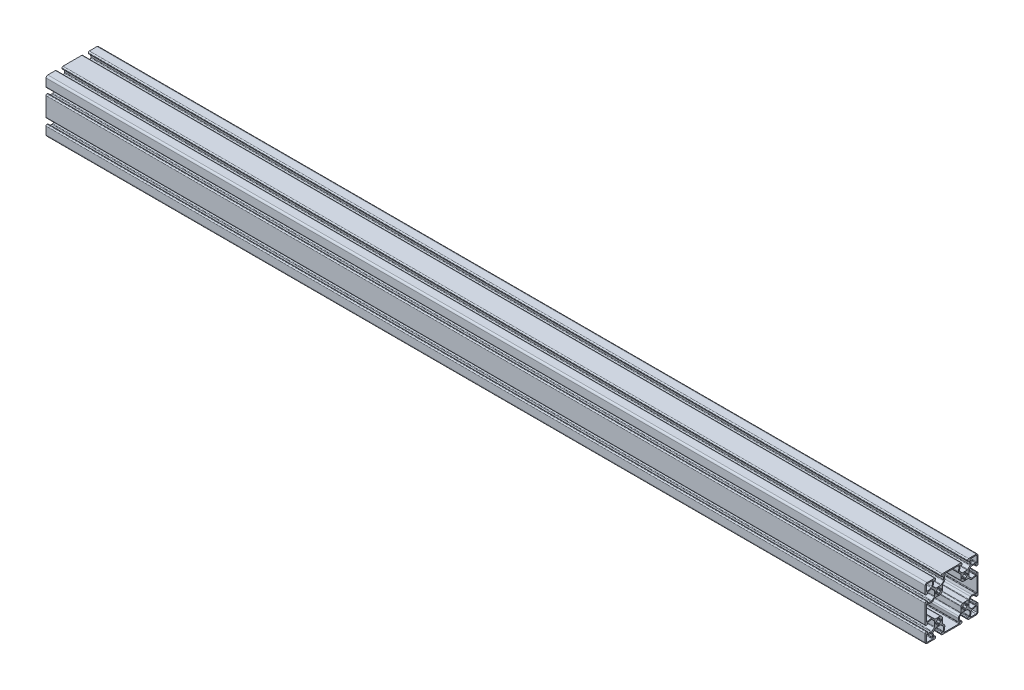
from build123d import *

# Parameters (mm, degrees)
EXTRUDE_1_DEPTH = 1000


with BuildPart() as part:
    # Sketch 1 → Extrude 1 (new body)
    with BuildSketch(Plane(origin=(0, 0, 0), x_dir=(0, 0, -1), z_dir=(1, 0, 0))):
        with BuildLine():
            Line((-15, 25.65), (-15, 4.35))
            ThreePointArc((-15, 4.35), (-14.648528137, 3.501471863), (-13.8, 3.15))
            Line((-13.8, 3.15), (-13.25, 3.15))
            ThreePointArc((-13.25, 3.15), (-12.719669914, 3.369669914), (-12.5, 3.9))
            Line((-12.5, 3.9), (-12.5, 4.874840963))
            ThreePointArc((-12.5, 4.874840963), (-12.383022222, 5.196234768), (-12.086824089, 5.367244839))
            Line((-12.086824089, 5.367244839), (-8.089371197, 6.072103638))
            ThreePointArc((-8.089371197, 6.072103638), (-7.615017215, 6.04101284), (-7.208616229, 5.794402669))
            Line((-7.208616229, 5.794402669), (-4.792893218, 3.378679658))
            ThreePointArc((-4.792893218, 3.378679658), (-4.576120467, 3.05425631), (-4.499999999, 2.671572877))
            Line((-4.499999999, 2.671572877), (-4.499999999, -2.671572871))
            ThreePointArc((-4.499999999, -2.671572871), (-4.576120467, -3.054256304), (-4.792893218, -3.378679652))
            Line((-4.792893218, -3.378679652), (-7.20861623, -5.794402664))
            ThreePointArc((-7.20861623, -5.794402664), (-7.615017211, -6.041012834), (-8.089371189, -6.072103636))
            Line((-8.089371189, -6.072103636), (-12.086824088, -5.367244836))
            ThreePointArc((-12.086824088, -5.367244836), (-12.383022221, -5.196234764), (-12.499999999, -4.874840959))
            Line((-12.499999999, -4.874840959), (-12.499999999, -3.899999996))
            ThreePointArc((-12.499999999, -3.899999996), (-12.719669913, -3.36966991), (-13.249999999, -3.149999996))
            Line((-13.249999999, -3.149999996), (-13.799999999, -3.149999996))
            ThreePointArc((-13.799999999, -3.149999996), (-14.648528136, -3.501471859), (-14.999999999, -4.349999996))
            Line((-14.999999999, -4.349999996), (-14.999999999, -12.999999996))
            ThreePointArc((-14.999999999, -12.999999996), (-14.414213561, -14.414213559), (-12.999999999, -14.999999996))
            Line((-12.999999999, -14.999999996), (-4.349999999, -14.999999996))
            ThreePointArc((-4.349999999, -14.999999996), (-3.501471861, -14.648528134), (-3.149999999, -13.799999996))
            Line((-3.149999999, -13.799999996), (-3.149999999, -13.249999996))
            ThreePointArc((-3.149999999, -13.249999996), (-3.369669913, -12.719669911), (-3.899999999, -12.499999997))
            Line((-3.899999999, -12.499999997), (-4.874840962, -12.499999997))
            ThreePointArc((-4.874840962, -12.499999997), (-5.196234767, -12.383022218), (-5.367244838, -12.086824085))
            Line((-5.367244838, -12.086824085), (-6.072103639, -8.089371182))
            ThreePointArc((-6.072103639, -8.089371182), (-6.041012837, -7.615017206), (-5.794402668, -7.208616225))
            Line((-5.794402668, -7.208616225), (-3.378679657, -4.792893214))
            ThreePointArc((-3.378679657, -4.792893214), (-3.054256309, -4.576120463), (-2.671572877, -4.499999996))
            Line((-2.671572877, -4.499999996), (2.671572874, -4.499999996))
            ThreePointArc((2.671572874, -4.499999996), (3.054256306, -4.576120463), (3.378679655, -4.792893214))
            Line((3.378679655, -4.792893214), (5.794402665, -7.208616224))
            ThreePointArc((5.794402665, -7.208616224), (6.041012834, -7.615017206), (6.072103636, -8.089371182))
            Line((6.072103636, -8.089371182), (5.367244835, -12.086824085))
            ThreePointArc((5.367244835, -12.086824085), (5.196234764, -12.383022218), (4.874840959, -12.499999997))
            Line((4.874840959, -12.499999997), (3.899999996, -12.499999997))
            ThreePointArc((3.899999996, -12.499999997), (3.36966991, -12.719669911), (3.149999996, -13.249999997))
            Line((3.149999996, -13.249999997), (3.149999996, -13.799999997))
            ThreePointArc((3.149999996, -13.799999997), (3.501471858, -14.648528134), (4.349999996, -14.999999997))
            Line((4.349999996, -14.999999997), (25.649999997, -14.999999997))
            ThreePointArc((25.649999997, -14.999999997), (26.498528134, -14.648528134), (26.849999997, -13.799999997))
            Line((26.849999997, -13.799999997), (26.849999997, -13.249999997))
            ThreePointArc((26.849999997, -13.249999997), (26.630330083, -12.719669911), (26.099999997, -12.499999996))
            Line((26.099999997, -12.499999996), (25.125159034, -12.499999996))
            ThreePointArc((25.125159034, -12.499999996), (24.803765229, -12.383022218), (24.632755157, -12.086824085))
            Line((24.632755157, -12.086824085), (23.927896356, -8.089371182))
            ThreePointArc((23.927896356, -8.089371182), (23.958987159, -7.615017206), (24.205597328, -7.208616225))
            Line((24.205597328, -7.208616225), (26.621320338, -4.792893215))
            ThreePointArc((26.621320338, -4.792893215), (26.945743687, -4.576120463), (27.328427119, -4.499999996))
            Line((27.328427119, -4.499999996), (32.67157287, -4.499999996))
            ThreePointArc((32.67157287, -4.499999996), (33.054256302, -4.576120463), (33.378679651, -4.792893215))
            Line((33.378679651, -4.792893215), (35.794402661, -7.208616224))
            ThreePointArc((35.794402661, -7.208616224), (36.04101283, -7.615017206), (36.072103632, -8.089371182))
            Line((36.072103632, -8.089371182), (35.367244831, -12.086824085))
            ThreePointArc((35.367244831, -12.086824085), (35.19623476, -12.383022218), (34.874840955, -12.499999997))
            Line((34.874840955, -12.499999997), (33.899999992, -12.499999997))
            ThreePointArc((33.899999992, -12.499999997), (33.369669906, -12.719669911), (33.149999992, -13.249999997))
            Line((33.149999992, -13.249999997), (33.149999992, -13.799999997))
            ThreePointArc((33.149999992, -13.799999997), (33.501471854, -14.648528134), (34.349999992, -14.999999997))
            Line((34.349999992, -14.999999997), (42.999999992, -14.999999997))
            ThreePointArc((42.999999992, -14.999999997), (44.414213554, -14.414213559), (44.999999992, -12.999999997))
            Line((44.999999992, -12.999999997), (44.999999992, -4.349999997))
            ThreePointArc((44.999999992, -4.349999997), (44.648528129, -3.501471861), (43.799999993, -3.149999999))
            Line((43.799999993, -3.149999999), (43.250025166, -3.149999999))
            ThreePointArc((43.250025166, -3.149999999), (42.719678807, -3.369661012), (42.499999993, -3.899999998))
            Line((42.499999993, -3.899999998), (42.499999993, -4.874840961))
            ThreePointArc((42.499999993, -4.874840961), (42.383022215, -5.196234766), (42.086824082, -5.367244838))
            Line((42.086824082, -5.367244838), (38.089371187, -6.072103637))
            ThreePointArc((38.089371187, -6.072103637), (37.61501721, -6.041012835), (37.208616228, -5.794402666))
            Line((37.208616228, -5.794402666), (34.792893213, -3.378679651))
            ThreePointArc((34.792893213, -3.378679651), (34.576120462, -3.054256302), (34.499999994, -2.67157287))
            Line((34.499999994, -2.67157287), (34.499999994, 2.671572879))
            ThreePointArc((34.499999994, 2.671572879), (34.576120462, 3.054256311), (34.792893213, 3.37867966))
            Line((34.792893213, 3.37867966), (37.208616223, 5.79440267))
            ThreePointArc((37.208616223, 5.79440267), (37.615017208, 6.041012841), (38.089371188, 6.07210364))
            Line((38.089371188, 6.07210364), (42.086824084, 5.367244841))
            ThreePointArc((42.086824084, 5.367244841), (42.383022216, 5.196234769), (42.499999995, 4.874840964))
            Line((42.499999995, 4.874840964), (42.499999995, 3.900000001))
            ThreePointArc((42.499999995, 3.900000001), (42.719678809, 3.369661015), (43.250025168, 3.150000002))
            Line((43.250025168, 3.150000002), (43.799999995, 3.150000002))
            ThreePointArc((43.799999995, 3.150000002), (44.648528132, 3.501471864), (44.999999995, 4.350000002))
            Line((44.999999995, 4.350000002), (44.999999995, 25.650000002))
            ThreePointArc((44.999999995, 25.650000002), (44.648528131, 26.498528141), (43.799999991, 26.850000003))
            Line((43.799999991, 26.850000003), (43.250025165, 26.850000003))
            ThreePointArc((43.250025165, 26.850000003), (42.719678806, 26.630338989), (42.499999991, 26.100000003))
            Line((42.499999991, 26.100000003), (42.499999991, 25.12515904))
            ThreePointArc((42.499999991, 25.12515904), (42.383022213, 24.803765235), (42.08682408, 24.632755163))
            Line((42.08682408, 24.632755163), (38.089371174, 23.927896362))
            ThreePointArc((38.089371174, 23.927896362), (37.615017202, 23.958987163), (37.208616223, 24.205597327))
            Line((37.208616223, 24.205597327), (34.792893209, 26.621320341))
            ThreePointArc((34.792893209, 26.621320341), (34.576120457, 26.94574369), (34.49999999, 27.328427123))
            Line((34.49999999, 27.328427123), (34.49999999, 32.671572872))
            ThreePointArc((34.49999999, 32.671572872), (34.576120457, 33.054256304), (34.792893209, 33.378679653))
            Line((34.792893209, 33.378679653), (37.208616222, 35.794402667))
            ThreePointArc((37.208616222, 35.794402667), (37.615017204, 36.041012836), (38.089371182, 36.072103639))
            Line((38.089371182, 36.072103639), (42.086824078, 35.367244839))
            ThreePointArc((42.086824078, 35.367244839), (42.38302221, 35.196234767), (42.499999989, 34.874840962))
            Line((42.499999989, 34.874840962), (42.499999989, 33.899999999))
            ThreePointArc((42.499999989, 33.899999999), (42.719669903, 33.369669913), (43.249999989, 33.149999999))
            Line((43.249999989, 33.149999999), (43.799999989, 33.149999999))
            ThreePointArc((43.799999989, 33.149999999), (44.648528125, 33.501471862), (44.999999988, 34.349999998))
            Line((44.999999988, 34.349999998), (44.999999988, 42.999999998))
            ThreePointArc((44.999999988, 42.999999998), (44.41421355, 44.414213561), (42.999999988, 44.999999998))
            Line((42.999999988, 44.999999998), (34.349999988, 44.999999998))
            ThreePointArc((34.349999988, 44.999999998), (33.50147185, 44.648528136), (33.149999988, 43.799999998))
            Line((33.149999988, 43.799999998), (33.149999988, 43.249999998))
            ThreePointArc((33.149999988, 43.249999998), (33.369669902, 42.719669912), (33.899999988, 42.499999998))
            Line((33.899999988, 42.499999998), (34.874840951, 42.499999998))
            ThreePointArc((34.874840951, 42.499999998), (35.196234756, 42.38302222), (35.367244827, 42.086824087))
            Line((35.367244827, 42.086824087), (36.072103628, 38.089371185))
            ThreePointArc((36.072103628, 38.089371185), (36.041012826, 37.615017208), (35.794402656, 37.208616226))
            Line((35.794402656, 37.208616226), (33.378679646, 34.792893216))
            ThreePointArc((33.378679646, 34.792893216), (33.054256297, 34.576120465), (32.671572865, 34.499999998))
            Line((32.671572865, 34.499999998), (27.328427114, 34.499999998))
            ThreePointArc((27.328427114, 34.499999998), (26.945743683, 34.576120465), (26.621320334, 34.792893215))
            Line((26.621320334, 34.792893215), (24.205597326, 37.208616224))
            ThreePointArc((24.205597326, 37.208616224), (23.958987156, 37.615017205), (23.927896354, 38.089371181))
            Line((23.927896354, 38.089371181), (24.632755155, 42.086824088))
            ThreePointArc((24.632755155, 42.086824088), (24.803765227, 42.38302222), (25.125159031, 42.499999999))
            Line((25.125159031, 42.499999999), (26.099999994, 42.499999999))
            ThreePointArc((26.099999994, 42.499999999), (26.63033008, 42.719669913), (26.849999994, 43.249999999))
            Line((26.849999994, 43.249999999), (26.849999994, 43.799999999))
            ThreePointArc((26.849999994, 43.799999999), (26.498528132, 44.648528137), (25.649999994, 44.999999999))
            Line((25.649999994, 44.999999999), (4.349999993, 44.999999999))
            ThreePointArc((4.349999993, 44.999999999), (3.501471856, 44.648528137), (3.149999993, 43.799999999))
            Line((3.149999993, 43.799999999), (3.149999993, 43.249999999))
            ThreePointArc((3.149999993, 43.249999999), (3.369669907, 42.719669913), (3.899999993, 42.499999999))
            Line((3.899999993, 42.499999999), (4.874840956, 42.499999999))
            ThreePointArc((4.874840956, 42.499999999), (5.196234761, 42.383022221), (5.367244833, 42.086824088))
            Line((5.367244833, 42.086824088), (6.072103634, 38.089371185))
            ThreePointArc((6.072103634, 38.089371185), (6.041012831, 37.615017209), (5.794402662, 37.208616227))
            Line((5.794402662, 37.208616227), (3.378679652, 34.792893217))
            ThreePointArc((3.378679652, 34.792893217), (3.054256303, 34.576120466), (2.671572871, 34.499999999))
            Line((2.671572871, 34.499999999), (-2.67157288, 34.499999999))
            ThreePointArc((-2.67157288, 34.499999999), (-3.054256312, 34.576120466), (-3.37867966, 34.792893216))
            Line((-3.37867966, 34.792893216), (-5.794402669, 37.208616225))
            ThreePointArc((-5.794402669, 37.208616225), (-6.041012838, 37.615017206), (-6.072103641, 38.089371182))
            Line((-6.072103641, 38.089371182), (-5.367244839, 42.086824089))
            ThreePointArc((-5.367244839, 42.086824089), (-5.196234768, 42.383022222), (-4.874840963, 42.5))
            Line((-4.874840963, 42.5), (-3.9, 42.5))
            ThreePointArc((-3.9, 42.5), (-3.369669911, 42.719669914), (-3.149999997, 43.250000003))
            Line((-3.149999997, 43.250000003), (-3.149999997, 43.800000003))
            ThreePointArc((-3.149999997, 43.800000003), (-3.50147186, 44.64852814), (-4.349999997, 45.000000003))
            Line((-4.349999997, 45.000000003), (-12.999999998, 45.000000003))
            ThreePointArc((-12.999999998, 45.000000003), (-14.41421356, 44.414213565), (-14.999999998, 43.000000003))
            Line((-14.999999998, 43.000000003), (-14.999999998, 34.350000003))
            ThreePointArc((-14.999999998, 34.350000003), (-14.648528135, 33.501471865), (-13.799999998, 33.150000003))
            Line((-13.799999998, 33.150000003), (-13.250025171, 33.150000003))
            ThreePointArc((-13.250025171, 33.150000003), (-12.719678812, 33.369661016), (-12.499999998, 33.900000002))
            Line((-12.499999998, 33.900000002), (-12.499999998, 34.874840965))
            ThreePointArc((-12.499999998, 34.874840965), (-12.383022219, 35.19623477), (-12.086824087, 35.367244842))
            Line((-12.086824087, 35.367244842), (-8.089371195, 36.072103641))
            ThreePointArc((-8.089371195, 36.072103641), (-7.615017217, 36.041012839), (-7.208616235, 35.794402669))
            Line((-7.208616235, 35.794402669), (-4.792893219, 33.378679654))
            ThreePointArc((-4.792893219, 33.378679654), (-4.576120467, 33.054256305), (-4.499999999, 32.671572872))
            Line((-4.499999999, 32.671572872), (-4.499999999, 27.328427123))
            ThreePointArc((-4.499999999, 27.328427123), (-4.576120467, 26.945743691), (-4.792893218, 26.621320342))
            Line((-4.792893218, 26.621320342), (-7.208616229, 24.205597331))
            ThreePointArc((-7.208616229, 24.205597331), (-7.615017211, 23.958987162), (-8.089371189, 23.927896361))
            Line((-8.089371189, 23.927896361), (-12.086824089, 24.632755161))
            ThreePointArc((-12.086824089, 24.632755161), (-12.383022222, 24.803765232), (-12.5, 25.125159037))
            Line((-12.5, 25.125159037), (-12.5, 26.1))
            ThreePointArc((-12.5, 26.1), (-12.719678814, 26.630338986), (-13.250025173, 26.85))
            Line((-13.250025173, 26.85), (-13.8, 26.85))
            ThreePointArc((-13.8, 26.85), (-14.648528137, 26.498528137), (-15, 25.65))
        make_face()
        with BuildLine():
            Line((-13.8, 23.350335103), (-13.8, 6.649664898))
            ThreePointArc((-13.8, 6.649664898), (-13.526133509, 6.203723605), (-13.004545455, 6.246295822))
            ThreePointArc((-13.004545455, 6.246295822), (-12.667267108, 6.43841207), (-12.295201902, 6.549014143))
            Line((-12.295201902, 6.549014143), (-8.297748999, 7.253872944))
            ThreePointArc((-8.297748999, 7.253872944), (-7.25417025, 7.185473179), (-6.360088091, 6.642930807))
            Line((-6.360088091, 6.642930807), (-4.510050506, 4.792893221))
            ThreePointArc((-4.510050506, 4.792893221), (-4.185627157, 4.57612047), (-3.802943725, 4.500000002))
            Line((-3.802943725, 4.500000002), (2.085786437, 4.500000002))
            ThreePointArc((2.085786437, 4.500000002), (2.46846987, 4.423879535), (2.792893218, 4.207106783))
            Line((2.792893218, 4.207106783), (4.207106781, 2.792893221))
            ThreePointArc((4.207106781, 2.792893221), (4.423879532, 2.468469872), (4.5, 2.08578644))
            Line((4.5, 2.08578644), (4.5, -3.802943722))
            ThreePointArc((4.5, -3.802943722), (4.576120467, -4.185627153), (4.792893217, -4.510050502))
            Line((4.792893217, -4.510050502), (6.642930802, -6.360088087))
            ThreePointArc((6.642930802, -6.360088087), (7.185473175, -7.254170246), (7.25387294, -8.297748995))
            Line((7.25387294, -8.297748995), (6.549014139, -12.295201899))
            ThreePointArc((6.549014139, -12.295201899), (6.438412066, -12.667267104), (6.246295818, -13.004545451))
            ThreePointArc((6.246295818, -13.004545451), (6.203723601, -13.526133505), (6.649664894, -13.799999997))
            Line((6.649664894, -13.799999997), (23.350335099, -13.799999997))
            ThreePointArc((23.350335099, -13.799999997), (23.796276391, -13.526133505), (23.753704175, -13.004545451))
            ThreePointArc((23.753704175, -13.004545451), (23.561587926, -12.667267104), (23.450985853, -12.295201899))
            Line((23.450985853, -12.295201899), (22.746127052, -8.297748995))
            ThreePointArc((22.746127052, -8.297748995), (22.814526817, -7.254170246), (23.35706919, -6.360088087))
            Line((23.35706919, -6.360088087), (25.207106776, -4.510050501))
            ThreePointArc((25.207106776, -4.510050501), (25.423879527, -4.185627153), (25.499999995, -3.80294372))
            Line((25.499999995, -3.80294372), (25.499999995, 2.085786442))
            ThreePointArc((25.499999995, 2.085786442), (25.576120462, 2.468469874), (25.792893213, 2.792893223))
            Line((25.792893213, 2.792893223), (27.207106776, 4.207106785))
            ThreePointArc((27.207106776, 4.207106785), (27.531530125, 4.423879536), (27.914213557, 4.500000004))
            Line((27.914213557, 4.500000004), (33.802943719, 4.500000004))
            ThreePointArc((33.802943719, 4.500000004), (34.185627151, 4.576120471), (34.5100505, 4.792893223))
            Line((34.5100505, 4.792893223), (36.360088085, 6.642930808))
            ThreePointArc((36.360088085, 6.642930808), (37.254170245, 7.185473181), (38.297748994, 7.253872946))
            Line((38.297748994, 7.253872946), (42.295201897, 6.549014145))
            ThreePointArc((42.295201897, 6.549014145), (42.667267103, 6.438412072), (43.00454545, 6.246295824))
            ThreePointArc((43.00454545, 6.246295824), (43.526133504, 6.203723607), (43.799999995, 6.6496649))
            Line((43.799999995, 6.6496649), (43.799999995, 23.350335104))
            ThreePointArc((43.799999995, 23.350335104), (43.526133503, 23.7962764), (43.004545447, 23.75370418))
            ThreePointArc((43.004545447, 23.75370418), (42.6672671, 23.561587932), (42.295201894, 23.450985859))
            Line((42.295201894, 23.450985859), (38.297748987, 22.746127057))
            ThreePointArc((38.297748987, 22.746127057), (37.254170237, 22.814526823), (36.360088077, 23.357069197))
            Line((36.360088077, 23.357069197), (34.510050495, 25.207106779))
            ThreePointArc((34.510050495, 25.207106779), (34.185627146, 25.423879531), (33.802943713, 25.499999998))
            Line((33.802943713, 25.499999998), (27.914213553, 25.499999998))
            ThreePointArc((27.914213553, 25.499999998), (27.53153012, 25.576120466), (27.207106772, 25.792893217))
            Line((27.207106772, 25.792893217), (25.792893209, 27.207106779))
            ThreePointArc((25.792893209, 27.207106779), (25.576120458, 27.531530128), (25.49999999, 27.914213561))
            Line((25.49999999, 27.914213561), (25.49999999, 33.802943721))
            ThreePointArc((25.49999999, 33.802943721), (25.423879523, 34.185627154), (25.207106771, 34.510050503))
            Line((25.207106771, 34.510050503), (23.357069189, 36.360088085))
            ThreePointArc((23.357069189, 36.360088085), (22.814526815, 37.254170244), (22.746127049, 38.297748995))
            Line((22.746127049, 38.297748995), (23.450985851, 42.295201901))
            ThreePointArc((23.450985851, 42.295201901), (23.561587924, 42.667267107), (23.753704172, 43.004545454))
            ThreePointArc((23.753704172, 43.004545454), (23.796276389, 43.526133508), (23.350335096, 43.799999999))
            Line((23.350335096, 43.799999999), (6.649664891, 43.799999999))
            ThreePointArc((6.649664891, 43.799999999), (6.203723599, 43.526133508), (6.246295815, 43.004545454))
            ThreePointArc((6.246295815, 43.004545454), (6.438412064, 42.667267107), (6.549014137, 42.295201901))
            Line((6.549014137, 42.295201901), (7.253872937, 38.297748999))
            ThreePointArc((7.253872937, 38.297748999), (7.185473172, 37.254170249), (6.642930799, 36.360088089))
            Line((6.642930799, 36.360088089), (4.792893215, 34.510050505))
            ThreePointArc((4.792893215, 34.510050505), (4.576120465, 34.185627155), (4.5, 33.802943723))
            Line((4.5, 33.802943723), (4.5, 27.914213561))
            ThreePointArc((4.5, 27.914213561), (4.423879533, 27.531530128), (4.207106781, 27.20710678))
            Line((4.207106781, 27.20710678), (2.792893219, 25.792893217))
            ThreePointArc((2.792893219, 25.792893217), (2.46846987, 25.576120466), (2.085786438, 25.499999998))
            Line((2.085786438, 25.499999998), (-3.802943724, 25.499999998))
            ThreePointArc((-3.802943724, 25.499999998), (-4.185627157, 25.423879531), (-4.510050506, 25.20710678))
            Line((-4.510050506, 25.20710678), (-6.36008809, 23.357069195))
            ThreePointArc((-6.36008809, 23.357069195), (-7.25417025, 22.814526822), (-8.297748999, 22.746127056))
            Line((-8.297748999, 22.746127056), (-12.295201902, 23.450985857))
            ThreePointArc((-12.295201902, 23.450985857), (-12.667267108, 23.56158793), (-13.004545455, 23.753704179))
            ThreePointArc((-13.004545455, 23.753704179), (-13.526133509, 23.796276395), (-13.8, 23.350335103))
        make_face(mode=Mode.SUBTRACT)
        with BuildLine():
            Line((-13.799999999, -12.799999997), (-13.799999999, -6.649664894))
            ThreePointArc((-13.799999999, -6.649664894), (-13.526133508, -6.203723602), (-13.004545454, -6.246295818))
            ThreePointArc((-13.004545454, -6.246295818), (-12.667267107, -6.438412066), (-12.295201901, -6.549014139))
            Line((-12.295201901, -6.549014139), (-8.099915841, -7.288756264))
            ThreePointArc((-8.099915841, -7.288756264), (-7.566457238, -7.566457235), (-7.288756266, -8.099915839))
            Line((-7.288756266, -8.099915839), (-6.549014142, -12.295201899))
            ThreePointArc((-6.549014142, -12.295201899), (-6.438412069, -12.667267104), (-6.246295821, -13.004545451))
            ThreePointArc((-6.246295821, -13.004545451), (-6.203723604, -13.526133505), (-6.649664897, -13.799999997))
            Line((-6.649664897, -13.799999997), (-12.799999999, -13.799999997))
            ThreePointArc((-12.799999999, -13.799999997), (-13.50710678, -13.507106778), (-13.799999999, -12.799999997))
        make_face(mode=Mode.SUBTRACT)
        with BuildLine():
            Line((3.5, -0.5), (3.5, 0.5))
            ThreePointArc((3.5, 0.5), (3.353553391, 0.853553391), (3, 1))
            Line((3, 1), (2.655654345, 1))
            ThreePointArc((2.655654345, 1), (2.403613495, 1.068172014), (2.220301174, 1.254098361))
            ThreePointArc((2.220301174, 1.254098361), (1.803122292, 1.803122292), (1.254098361, 2.220301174))
            ThreePointArc((1.254098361, 2.220301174), (1.068172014, 2.403613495), (1, 2.655654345))
            Line((1, 2.655654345), (1, 3))
            ThreePointArc((1, 3), (0.853553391, 3.353553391), (0.5, 3.5))
            Line((0.5, 3.5), (-0.5, 3.5))
            ThreePointArc((-0.5, 3.5), (-0.853553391, 3.353553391), (-1, 3))
            Line((-1, 3), (-1, 2.655654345))
            ThreePointArc((-1, 2.655654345), (-1.068172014, 2.403613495), (-1.254098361, 2.220301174))
            ThreePointArc((-1.254098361, 2.220301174), (-1.803122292, 1.803122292), (-2.220301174, 1.254098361))
            ThreePointArc((-2.220301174, 1.254098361), (-2.403613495, 1.068172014), (-2.655654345, 1))
            Line((-2.655654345, 1), (-3, 1))
            ThreePointArc((-3, 1), (-3.353553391, 0.853553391), (-3.5, 0.5))
            Line((-3.5, 0.5), (-3.5, -0.5))
            ThreePointArc((-3.5, -0.5), (-3.353553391, -0.853553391), (-3, -1))
            Line((-3, -1), (-2.655654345, -1))
            ThreePointArc((-2.655654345, -1), (-2.403613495, -1.068172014), (-2.220301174, -1.254098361))
            ThreePointArc((-2.220301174, -1.254098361), (-1.803122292, -1.803122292), (-1.254098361, -2.220301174))
            ThreePointArc((-1.254098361, -2.220301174), (-1.068172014, -2.403613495), (-1, -2.655654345))
            Line((-1, -2.655654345), (-1, -3))
            ThreePointArc((-1, -3), (-0.853553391, -3.353553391), (-0.5, -3.5))
            Line((-0.5, -3.5), (0.5, -3.5))
            ThreePointArc((0.5, -3.5), (0.853553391, -3.353553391), (1, -3))
            Line((1, -3), (1, -2.655654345))
            ThreePointArc((1, -2.655654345), (1.068172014, -2.403613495), (1.254098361, -2.220301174))
            ThreePointArc((1.254098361, -2.220301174), (1.803122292, -1.803122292), (2.220301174, -1.254098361))
            ThreePointArc((2.220301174, -1.254098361), (2.403613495, -1.068172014), (2.655654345, -1))
            Line((2.655654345, -1), (3, -1))
            ThreePointArc((3, -1), (3.353553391, -0.853553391), (3.5, -0.5))
        make_face(mode=Mode.SUBTRACT)
        with BuildLine():
            Line((37.288756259, -8.099915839), (36.549014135, -12.295201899))
            ThreePointArc((36.549014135, -12.295201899), (36.438412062, -12.667267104), (36.246295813, -13.004545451))
            ThreePointArc((36.246295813, -13.004545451), (36.203723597, -13.526133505), (36.64966489, -13.799999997))
            Line((36.64966489, -13.799999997), (42.799999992, -13.799999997))
            ThreePointArc((42.799999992, -13.799999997), (43.507106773, -13.507106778), (43.799999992, -12.799999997))
            Line((43.799999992, -12.799999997), (43.799999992, -6.649664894))
            ThreePointArc((43.799999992, -6.649664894), (43.5261335, -6.203723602), (43.004545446, -6.246295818))
            ThreePointArc((43.004545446, -6.246295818), (42.6672671, -6.438412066), (42.295201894, -6.549014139))
            Line((42.295201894, -6.549014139), (38.099915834, -7.288756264))
            ThreePointArc((38.099915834, -7.288756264), (37.566457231, -7.566457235), (37.288756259, -8.099915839))
        make_face(mode=Mode.SUBTRACT)
        with BuildLine():
            Line((26.5, -0.5), (26.5, 0.5))
            ThreePointArc((26.5, 0.5), (26.646446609, 0.853553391), (27, 1))
            Line((27, 1), (27.344345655, 1))
            ThreePointArc((27.344345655, 1), (27.596386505, 1.068172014), (27.779698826, 1.254098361))
            ThreePointArc((27.779698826, 1.254098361), (28.196877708, 1.803122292), (28.745901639, 2.220301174))
            ThreePointArc((28.745901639, 2.220301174), (28.931827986, 2.403613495), (29, 2.655654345))
            Line((29, 2.655654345), (29, 3))
            ThreePointArc((29, 3), (29.146446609, 3.353553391), (29.5, 3.5))
            Line((29.5, 3.5), (30.5, 3.5))
            ThreePointArc((30.5, 3.5), (30.853553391, 3.353553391), (31, 3))
            Line((31, 3), (31, 2.655654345))
            ThreePointArc((31, 2.655654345), (31.068172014, 2.403613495), (31.254098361, 2.220301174))
            ThreePointArc((31.254098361, 2.220301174), (31.803122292, 1.803122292), (32.220301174, 1.254098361))
            ThreePointArc((32.220301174, 1.254098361), (32.403613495, 1.068172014), (32.655654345, 1))
            Line((32.655654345, 1), (33, 1))
            ThreePointArc((33, 1), (33.353553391, 0.853553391), (33.5, 0.5))
            Line((33.5, 0.5), (33.5, -0.5))
            ThreePointArc((33.5, -0.5), (33.353553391, -0.853553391), (33, -1))
            Line((33, -1), (32.655654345, -1))
            ThreePointArc((32.655654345, -1), (32.403613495, -1.068172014), (32.220301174, -1.254098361))
            ThreePointArc((32.220301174, -1.254098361), (31.803122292, -1.803122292), (31.254098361, -2.220301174))
            ThreePointArc((31.254098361, -2.220301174), (31.068172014, -2.403613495), (31, -2.655654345))
            Line((31, -2.655654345), (31, -3))
            ThreePointArc((31, -3), (30.853553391, -3.353553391), (30.5, -3.5))
            Line((30.5, -3.5), (29.5, -3.5))
            ThreePointArc((29.5, -3.5), (29.146446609, -3.353553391), (29, -3))
            Line((29, -3), (29, -2.655654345))
            ThreePointArc((29, -2.655654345), (28.931827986, -2.403613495), (28.745901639, -2.220301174))
            ThreePointArc((28.745901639, -2.220301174), (28.196877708, -1.803122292), (27.779698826, -1.254098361))
            ThreePointArc((27.779698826, -1.254098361), (27.596386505, -1.068172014), (27.344345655, -1))
            Line((27.344345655, -1), (27, -1))
            ThreePointArc((27, -1), (26.646446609, -0.853553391), (26.5, -0.5))
        make_face(mode=Mode.SUBTRACT)
        with BuildLine():
            Line((0.5, 33.5), (-0.5, 33.5))
            ThreePointArc((-0.5, 33.5), (-0.853553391, 33.353553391), (-1, 33))
            Line((-1, 33), (-1, 32.655654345))
            ThreePointArc((-1, 32.655654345), (-1.068172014, 32.403613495), (-1.254098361, 32.220301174))
            ThreePointArc((-1.254098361, 32.220301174), (-1.803122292, 31.803122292), (-2.220301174, 31.254098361))
            ThreePointArc((-2.220301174, 31.254098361), (-2.403613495, 31.068172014), (-2.655654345, 31))
            Line((-2.655654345, 31), (-3, 31))
            ThreePointArc((-3, 31), (-3.353553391, 30.853553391), (-3.5, 30.5))
            Line((-3.5, 30.5), (-3.5, 29.5))
            ThreePointArc((-3.5, 29.5), (-3.353553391, 29.146446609), (-3, 29))
            Line((-3, 29), (-2.655654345, 29))
            ThreePointArc((-2.655654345, 29), (-2.403613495, 28.931827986), (-2.220301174, 28.745901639))
            ThreePointArc((-2.220301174, 28.745901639), (-1.803122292, 28.196877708), (-1.254098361, 27.779698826))
            ThreePointArc((-1.254098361, 27.779698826), (-1.068172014, 27.596386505), (-1, 27.344345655))
            Line((-1, 27.344345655), (-1, 27))
            ThreePointArc((-1, 27), (-0.853553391, 26.646446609), (-0.5, 26.5))
            Line((-0.5, 26.5), (0.5, 26.5))
            ThreePointArc((0.5, 26.5), (0.853553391, 26.646446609), (1, 27))
            Line((1, 27), (1, 27.344345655))
            ThreePointArc((1, 27.344345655), (1.068172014, 27.596386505), (1.254098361, 27.779698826))
            ThreePointArc((1.254098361, 27.779698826), (1.803122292, 28.196877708), (2.220301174, 28.745901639))
            ThreePointArc((2.220301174, 28.745901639), (2.403613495, 28.931827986), (2.655654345, 29))
            Line((2.655654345, 29), (3, 29))
            ThreePointArc((3, 29), (3.353553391, 29.146446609), (3.5, 29.5))
            Line((3.5, 29.5), (3.5, 30.5))
            ThreePointArc((3.5, 30.5), (3.353553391, 30.853553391), (3, 31))
            Line((3, 31), (2.655654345, 31))
            ThreePointArc((2.655654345, 31), (2.403613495, 31.068172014), (2.220301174, 31.254098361))
            ThreePointArc((2.220301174, 31.254098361), (1.803122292, 31.803122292), (1.254098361, 32.220301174))
            ThreePointArc((1.254098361, 32.220301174), (1.068172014, 32.403613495), (1, 32.655654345))
            Line((1, 32.655654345), (1, 33))
            ThreePointArc((1, 33), (0.853553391, 33.353553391), (0.5, 33.5))
        make_face(mode=Mode.SUBTRACT)
        with BuildLine():
            Line((-12.8, 43.8), (-6.649664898, 43.8))
            ThreePointArc((-6.649664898, 43.8), (-6.203723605, 43.526133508), (-6.246295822, 43.004545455))
            ThreePointArc((-6.246295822, 43.004545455), (-6.43841207, 42.667267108), (-6.549014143, 42.295201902))
            Line((-6.549014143, 42.295201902), (-7.288756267, 38.099915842))
            ThreePointArc((-7.288756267, 38.099915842), (-7.566457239, 37.566457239), (-8.099915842, 37.288756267))
            Line((-8.099915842, 37.288756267), (-13.213175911, 36.387150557))
            ThreePointArc((-13.213175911, 36.387150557), (-13.621393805, 36.496532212), (-13.8, 36.879554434))
            Line((-13.8, 36.879554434), (-13.8, 42.8))
            ThreePointArc((-13.8, 42.8), (-13.507106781, 43.507106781), (-12.8, 43.8))
        make_face(mode=Mode.SUBTRACT)
        with BuildLine():
            Line((29, 32.655654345), (29, 33))
            ThreePointArc((29, 33), (29.146446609, 33.353553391), (29.5, 33.5))
            Line((29.5, 33.5), (30.5, 33.5))
            ThreePointArc((30.5, 33.5), (30.853553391, 33.353553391), (31, 33))
            Line((31, 33), (31, 32.655654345))
            ThreePointArc((31, 32.655654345), (31.068172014, 32.403613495), (31.254098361, 32.220301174))
            ThreePointArc((31.254098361, 32.220301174), (31.803122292, 31.803122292), (32.220301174, 31.254098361))
            ThreePointArc((32.220301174, 31.254098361), (32.403613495, 31.068172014), (32.655654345, 31))
            Line((32.655654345, 31), (33, 31))
            ThreePointArc((33, 31), (33.353553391, 30.853553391), (33.5, 30.5))
            Line((33.5, 30.5), (33.5, 29.5))
            ThreePointArc((33.5, 29.5), (33.353553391, 29.146446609), (33, 29))
            Line((33, 29), (32.655654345, 29))
            ThreePointArc((32.655654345, 29), (32.403613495, 28.931827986), (32.220301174, 28.745901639))
            ThreePointArc((32.220301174, 28.745901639), (31.803122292, 28.196877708), (31.254098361, 27.779698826))
            ThreePointArc((31.254098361, 27.779698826), (31.068172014, 27.596386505), (31, 27.344345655))
            Line((31, 27.344345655), (31, 27))
            ThreePointArc((31, 27), (30.853553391, 26.646446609), (30.5, 26.5))
            Line((30.5, 26.5), (29.5, 26.5))
            ThreePointArc((29.5, 26.5), (29.146446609, 26.646446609), (29, 27))
            Line((29, 27), (29, 27.344345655))
            ThreePointArc((29, 27.344345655), (28.931827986, 27.596386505), (28.745901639, 27.779698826))
            ThreePointArc((28.745901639, 27.779698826), (28.196877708, 28.196877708), (27.779698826, 28.745901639))
            ThreePointArc((27.779698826, 28.745901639), (27.596386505, 28.931827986), (27.344345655, 29))
            Line((27.344345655, 29), (27, 29))
            ThreePointArc((27, 29), (26.646446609, 29.146446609), (26.5, 29.5))
            Line((26.5, 29.5), (26.5, 30.5))
            ThreePointArc((26.5, 30.5), (26.646446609, 30.853553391), (27, 31))
            Line((27, 31), (27.344345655, 31))
            ThreePointArc((27.344345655, 31), (27.596386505, 31.068172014), (27.779698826, 31.254098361))
            ThreePointArc((27.779698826, 31.254098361), (28.196877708, 31.803122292), (28.745901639, 32.220301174))
            ThreePointArc((28.745901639, 32.220301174), (28.931827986, 32.403613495), (29, 32.655654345))
        make_face(mode=Mode.SUBTRACT)
        with BuildLine():
            Line((42.799999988, 43.799999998), (36.649664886, 43.799999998))
            ThreePointArc((36.649664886, 43.799999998), (36.203723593, 43.526133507), (36.24629581, 43.004545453))
            ThreePointArc((36.24629581, 43.004545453), (36.438412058, 42.667267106), (36.549014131, 42.2952019))
            Line((36.549014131, 42.2952019), (37.288756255, 38.099915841))
            ThreePointArc((37.288756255, 38.099915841), (37.566457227, 37.566457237), (38.09991583, 37.288756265))
            Line((38.09991583, 37.288756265), (42.29520189, 36.549014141))
            ThreePointArc((42.29520189, 36.549014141), (42.667267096, 36.438412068), (43.004545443, 36.24629582))
            ThreePointArc((43.004545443, 36.24629582), (43.526133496, 36.203723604), (43.799999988, 36.649664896))
            Line((43.799999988, 36.649664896), (43.799999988, 42.799999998))
            ThreePointArc((43.799999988, 42.799999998), (43.507106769, 43.50710678), (42.799999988, 43.799999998))
        make_face(mode=Mode.SUBTRACT)
    extrude(amount=EXTRUDE_1_DEPTH)


solid = part.part
